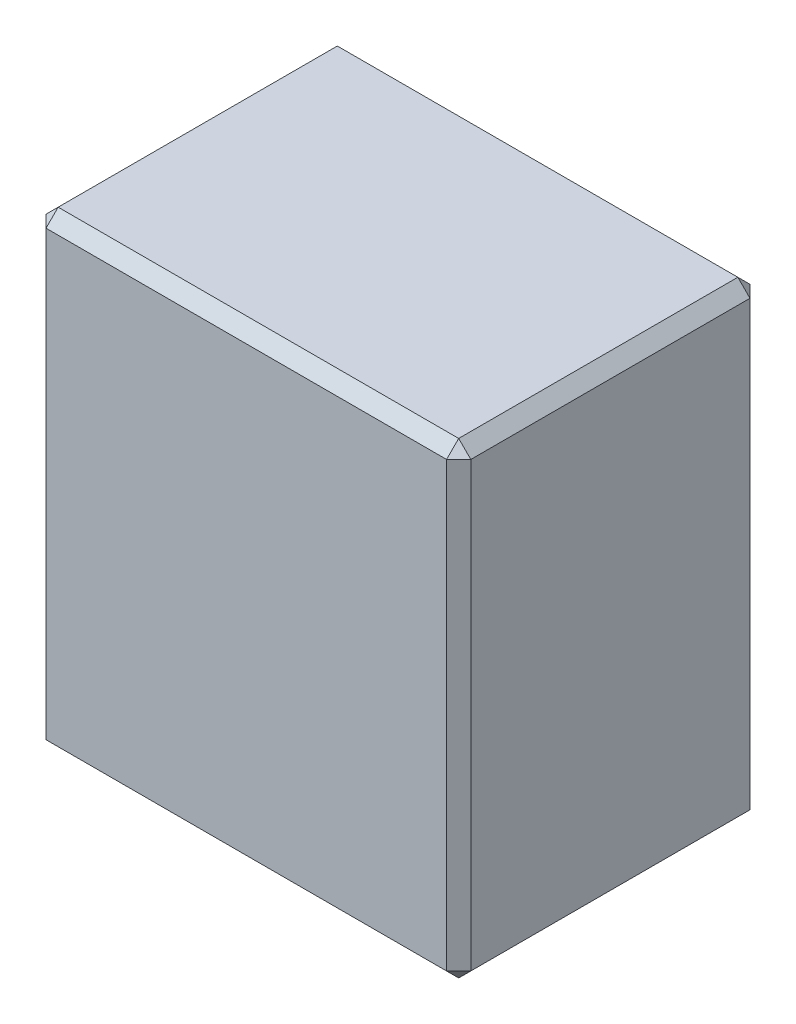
from build123d import *

# Parameters (mm, degrees)
ESQUISSE1_W      = 3.5
ESQUISSE1_H      = 2.5
EXTRUSION1_DEPTH = 3.85
CHANFREIN1_SIZE  = 0.1


with BuildPart() as part:
    # Esquisse1 → Extrusion1 (new body)
    with BuildSketch(Plane(origin=(0, 0, 0), x_dir=(1, 0, 0), z_dir=(0, 1, 0))):
        with Locations((1.75, 1.25)):
            Rectangle(ESQUISSE1_W, ESQUISSE1_H)
    extrude(amount=EXTRUSION1_DEPTH)

    # Chanfrein1
    chanfrein1_edges = [part.edges().sort_by_distance(p)[0] for p in [
        (3.5, 3.85, -1.25),
        (1.75, 3.85, -2.5),
        (0, 3.85, -1.25),
        (1.75, 0, -2.5),
        (3.5, 0, -1.25),
        (1.75, 0, 0),
        (0, 0, -1.25),
        (1.75, 3.85, 0),
        (0, 1.925, -2.5),
        (3.5, 1.925, -2.5),
        (3.5, 1.925, 0),
        (0, 1.925, 0),
    ]]
    chamfer(chanfrein1_edges, length=CHANFREIN1_SIZE)


solid = part.part
